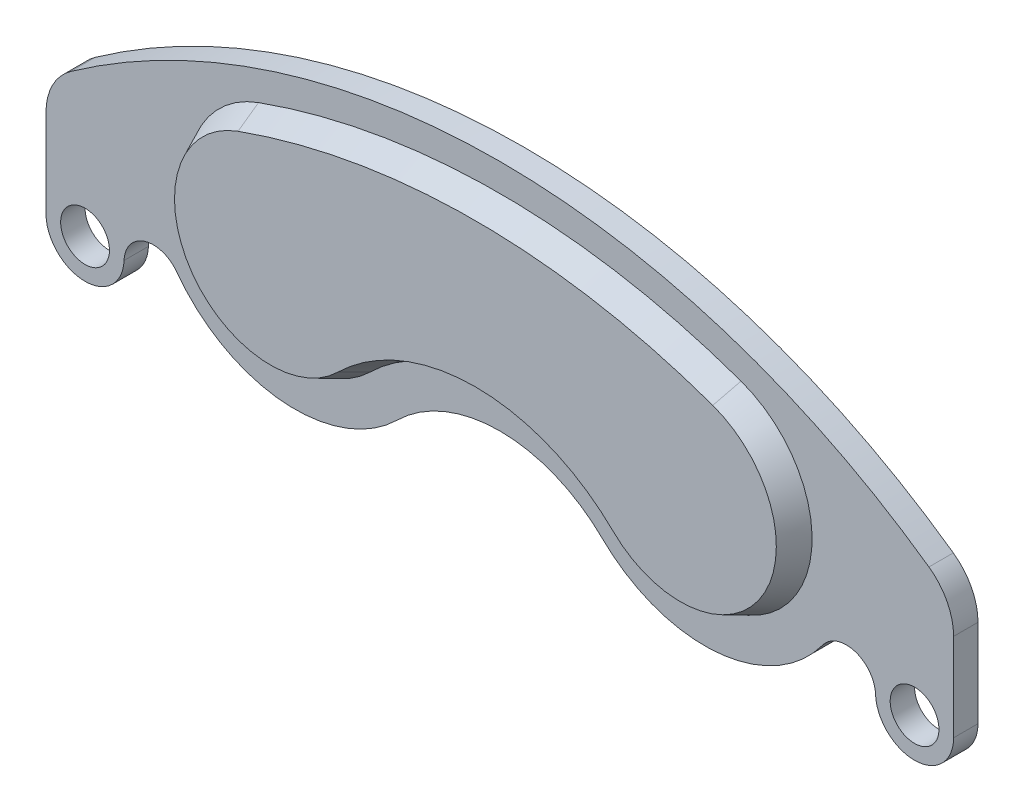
ISO-10303-21;
HEADER;
FILE_DESCRIPTION(('STEP AP214'),'2;1');
FILE_NAME('part.step','',(''),(''),'','','');
FILE_SCHEMA(('AUTOMOTIVE_DESIGN { 1 0 10303 214 1 1 1 1 }'));
ENDSEC;
DATA;
#1=APPLICATION_CONTEXT('core data for automotive mechanical design processes');
#2=APPLICATION_PROTOCOL_DEFINITION('international standard','automotive_design',2000,#1);
#3=PRODUCT_CONTEXT('',#1,'mechanical');
#4=PRODUCT('Part','Part','',(#3));
#5=PRODUCT_RELATED_PRODUCT_CATEGORY('part','',(#4));
#6=PRODUCT_DEFINITION_FORMATION('','',#4);
#7=PRODUCT_DEFINITION_CONTEXT('part definition',#1,'design');
#8=PRODUCT_DEFINITION('design','',#6,#7);
#9=PRODUCT_DEFINITION_SHAPE('','',#8);
#10=(LENGTH_UNIT() NAMED_UNIT(*) SI_UNIT(.MILLI.,.METRE.));
#11=(NAMED_UNIT(*) PLANE_ANGLE_UNIT() SI_UNIT($,.RADIAN.));
#12=(NAMED_UNIT(*) SI_UNIT($,.STERADIAN.) SOLID_ANGLE_UNIT());
#13=UNCERTAINTY_MEASURE_WITH_UNIT(LENGTH_MEASURE(1.E-05),#10,'distance_accuracy_value','');
#14=(GEOMETRIC_REPRESENTATION_CONTEXT(3) GLOBAL_UNCERTAINTY_ASSIGNED_CONTEXT((#13)) GLOBAL_UNIT_ASSIGNED_CONTEXT((#10,
#11,#12)) REPRESENTATION_CONTEXT('',''));
#15=CARTESIAN_POINT('',(0.,0.,0.));
#16=DIRECTION('',(0.,0.,1.));
#17=DIRECTION('',(1.,0.,0.));
#18=AXIS2_PLACEMENT_3D('',#15,#16,#17);
#19=CARTESIAN_POINT('',(21.,21.4242852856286,1.25));
#20=DIRECTION('',(0.,0.,1.));
#21=DIRECTION('',(1.,0.,0.));
#22=AXIS2_PLACEMENT_3D('',#19,#20,#21);
#23=PLANE('',#22);
#24=CARTESIAN_POINT('',(0.,0.,1.25));
#25=DIRECTION('',(0.,0.,-1.));
#26=DIRECTION('',(-1.,0.,0.));
#27=AXIS2_PLACEMENT_3D('',#24,#25,#26);
#28=CIRCLE('',#27,19.);
#29=CARTESIAN_POINT('',(-13.3,13.5687140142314,1.25));
#30=VERTEX_POINT('',#29);
#31=CARTESIAN_POINT('',(13.3,13.5687140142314,1.25));
#32=VERTEX_POINT('',#31);
#33=EDGE_CURVE('E354',#30,#32,#28,.T.);
#34=ORIENTED_EDGE('',*,*,#33,.F.);
#35=CARTESIAN_POINT('',(-21.,21.4242852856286,1.25));
#36=DIRECTION('',(0.,0.,1.));
#37=DIRECTION('',(1.,0.,0.));
#38=AXIS2_PLACEMENT_3D('',#35,#36,#37);
#39=CIRCLE('',#38,11.);
#40=CARTESIAN_POINT('',(-24.7165122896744,31.7774266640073,1.25));
#41=VERTEX_POINT('',#40);
#42=EDGE_CURVE('E358',#41,#30,#39,.T.);
#43=ORIENTED_EDGE('',*,*,#42,.F.);
#44=CARTESIAN_POINT('',(0.,-37.0757147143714,1.25));
#45=DIRECTION('',(0.,0.,1.));
#46=DIRECTION('',(1.,0.,0.));
#47=AXIS2_PLACEMENT_3D('',#44,#45,#46);
#48=CIRCLE('',#47,73.155048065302);
#49=CARTESIAN_POINT('',(24.7165122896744,31.7774266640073,1.25));
#50=VERTEX_POINT('',#49);
#51=EDGE_CURVE('E336',#50,#41,#48,.T.);
#52=ORIENTED_EDGE('',*,*,#51,.F.);
#53=CARTESIAN_POINT('',(21.,21.4242852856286,1.25));
#54=DIRECTION('',(0.,0.,1.));
#55=DIRECTION('',(1.,0.,0.));
#56=AXIS2_PLACEMENT_3D('',#53,#54,#55);
#57=CIRCLE('',#56,11.);
#58=EDGE_CURVE('E351',#32,#50,#57,.T.);
#59=ORIENTED_EDGE('',*,*,#58,.F.);
#60=EDGE_LOOP('',(#34,#43,#52,#59));
#61=FACE_BOUND('',#60,.T.);
#62=CARTESIAN_POINT('',(-42.5,11.0185056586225,1.25));
#63=DIRECTION('',(0.,0.,1.));
#64=DIRECTION('',(1.,0.,0.));
#65=AXIS2_PLACEMENT_3D('',#62,#63,#64);
#66=CIRCLE('',#65,2.5);
#67=CARTESIAN_POINT('',(-40.,11.0185056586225,1.25));
#68=VERTEX_POINT('',#67);
#69=EDGE_CURVE('E181',#68,#68,#66,.T.);
#70=ORIENTED_EDGE('',*,*,#69,.F.);
#71=EDGE_LOOP('',(#70));
#72=FACE_BOUND('',#71,.T.);
#73=CARTESIAN_POINT('',(21.,21.4242852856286,1.25));
#74=DIRECTION('',(0.,0.,1.));
#75=DIRECTION('',(1.,0.,0.));
#76=AXIS2_PLACEMENT_3D('',#73,#74,#75);
#77=CIRCLE('',#76,15.);
#78=CARTESIAN_POINT('',(10.5,10.7121426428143,1.25));
#79=VERTEX_POINT('',#78);
#80=CARTESIAN_POINT('',(33.0871551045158,12.5416797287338,1.25));
#81=VERTEX_POINT('',#80);
#82=EDGE_CURVE('E213',#79,#81,#77,.T.);
#83=ORIENTED_EDGE('',*,*,#82,.T.);
#84=CARTESIAN_POINT('',(35.504586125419,10.7651586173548,1.25));
#85=DIRECTION('',(0.,0.,-1.));
#86=DIRECTION('',(-1.,0.,0.));
#87=AXIS2_PLACEMENT_3D('',#84,#85,#86);
#88=CIRCLE('',#87,3.);
#89=CARTESIAN_POINT('',(38.5026206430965,10.8737359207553,1.25));
#90=VERTEX_POINT('',#89);
#91=EDGE_CURVE('E117',#81,#90,#88,.T.);
#92=ORIENTED_EDGE('',*,*,#91,.T.);
#93=CARTESIAN_POINT('',(42.5,11.0185056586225,1.25));
#94=DIRECTION('',(0.,0.,1.));
#95=DIRECTION('',(1.,0.,0.));
#96=AXIS2_PLACEMENT_3D('',#93,#94,#95);
#97=CIRCLE('',#96,4.);
#98=CARTESIAN_POINT('',(46.5,11.0185056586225,1.25));
#99=VERTEX_POINT('',#98);
#100=EDGE_CURVE('E250',#90,#99,#97,.T.);
#101=ORIENTED_EDGE('',*,*,#100,.T.);
#102=DIRECTION('',(0.,1.,0.));
#103=VECTOR('',#102,1.);
#104=CARTESIAN_POINT('',(46.5,11.0185056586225,1.25));
#105=LINE('',#104,#103);
#106=CARTESIAN_POINT('',(46.5,20.0185056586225,1.25));
#107=VERTEX_POINT('',#106);
#108=EDGE_CURVE('E269',#99,#107,#105,.T.);
#109=ORIENTED_EDGE('',*,*,#108,.T.);
#110=CARTESIAN_POINT('',(40.5,20.0185056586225,1.25));
#111=DIRECTION('',(0.,0.,1.));
#112=DIRECTION('',(1.,0.,0.));
#113=AXIS2_PLACEMENT_3D('',#110,#111,#112);
#114=CIRCLE('',#113,6.);
#115=CARTESIAN_POINT('',(43.9714285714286,24.9122959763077,1.25));
#116=VERTEX_POINT('',#115);
#117=EDGE_CURVE('E265',#107,#116,#114,.T.);
#118=ORIENTED_EDGE('',*,*,#117,.T.);
#119=CARTESIAN_POINT('',(0.,-37.0757147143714,1.25));
#120=DIRECTION('',(0.,0.,1.));
#121=DIRECTION('',(1.,0.,0.));
#122=AXIS2_PLACEMENT_3D('',#119,#120,#121);
#123=CIRCLE('',#122,76.);
#124=CARTESIAN_POINT('',(-43.9714285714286,24.9122959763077,1.25));
#125=VERTEX_POINT('',#124);
#126=EDGE_CURVE('E268',#116,#125,#123,.T.);
#127=ORIENTED_EDGE('',*,*,#126,.T.);
#128=CARTESIAN_POINT('',(-40.5,20.0185056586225,1.25));
#129=DIRECTION('',(0.,0.,1.));
#130=DIRECTION('',(-1.,0.,0.));
#131=AXIS2_PLACEMENT_3D('',#128,#129,#130);
#132=CIRCLE('',#131,6.);
#133=CARTESIAN_POINT('',(-46.5,20.0185056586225,1.25));
#134=VERTEX_POINT('',#133);
#135=EDGE_CURVE('E273',#125,#134,#132,.T.);
#136=ORIENTED_EDGE('',*,*,#135,.T.);
#137=DIRECTION('',(0.,-1.,0.));
#138=VECTOR('',#137,1.);
#139=CARTESIAN_POINT('',(-46.5,11.0185056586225,1.25));
#140=LINE('',#139,#138);
#141=CARTESIAN_POINT('',(-46.5,11.0185056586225,1.25));
#142=VERTEX_POINT('',#141);
#143=EDGE_CURVE('E280',#134,#142,#140,.T.);
#144=ORIENTED_EDGE('',*,*,#143,.T.);
#145=CARTESIAN_POINT('',(-42.5,11.0185056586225,1.25));
#146=DIRECTION('',(0.,0.,1.));
#147=DIRECTION('',(-1.,0.,0.));
#148=AXIS2_PLACEMENT_3D('',#145,#146,#147);
#149=CIRCLE('',#148,4.00000000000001);
#150=CARTESIAN_POINT('',(-38.5026206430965,10.8737359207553,1.25));
#151=VERTEX_POINT('',#150);
#152=EDGE_CURVE('E151',#142,#151,#149,.T.);
#153=ORIENTED_EDGE('',*,*,#152,.T.);
#154=CARTESIAN_POINT('',(-35.504586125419,10.7651586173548,1.25));
#155=DIRECTION('',(0.,0.,-1.));
#156=DIRECTION('',(1.,0.,0.));
#157=AXIS2_PLACEMENT_3D('',#154,#155,#156);
#158=CIRCLE('',#157,3.);
#159=CARTESIAN_POINT('',(-33.0871551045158,12.5416797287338,1.25));
#160=VERTEX_POINT('',#159);
#161=EDGE_CURVE('E144',#151,#160,#158,.T.);
#162=ORIENTED_EDGE('',*,*,#161,.T.);
#163=CARTESIAN_POINT('',(-21.,21.4242852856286,1.25));
#164=DIRECTION('',(0.,0.,1.));
#165=DIRECTION('',(-1.,0.,0.));
#166=AXIS2_PLACEMENT_3D('',#163,#164,#165);
#167=CIRCLE('',#166,15.);
#168=CARTESIAN_POINT('',(-10.5,10.7121426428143,1.25));
#169=VERTEX_POINT('',#168);
#170=EDGE_CURVE('E148',#160,#169,#167,.T.);
#171=ORIENTED_EDGE('',*,*,#170,.T.);
#172=CARTESIAN_POINT('',(0.,0.,1.25));
#173=DIRECTION('',(0.,0.,-1.));
#174=DIRECTION('',(-1.,0.,0.));
#175=AXIS2_PLACEMENT_3D('',#172,#173,#174);
#176=CIRCLE('',#175,15.);
#177=EDGE_CURVE('E64',#169,#79,#176,.T.);
#178=ORIENTED_EDGE('',*,*,#177,.T.);
#179=EDGE_LOOP('',(#83,#92,#101,#109,#118,#127,#136,#144,#153,#162,#171,#178));
#180=FACE_BOUND('',#179,.T.);
#181=CARTESIAN_POINT('',(42.5,11.0185056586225,1.25));
#182=DIRECTION('',(0.,0.,1.));
#183=DIRECTION('',(-1.,0.,0.));
#184=AXIS2_PLACEMENT_3D('',#181,#182,#183);
#185=CIRCLE('',#184,2.5);
#186=CARTESIAN_POINT('',(40.,11.0185056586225,1.25));
#187=VERTEX_POINT('',#186);
#188=EDGE_CURVE('E307',#187,#187,#185,.T.);
#189=ORIENTED_EDGE('',*,*,#188,.F.);
#190=EDGE_LOOP('',(#189));
#191=FACE_BOUND('',#190,.T.);
#192=ADVANCED_FACE('F39',(#61,#72,#180,#191),#23,.T.);
#193=CARTESIAN_POINT('',(21.,21.4242852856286,-1.25));
#194=DIRECTION('',(0.,0.,1.));
#195=DIRECTION('',(1.,0.,0.));
#196=AXIS2_PLACEMENT_3D('',#193,#194,#195);
#197=PLANE('',#196);
#198=CARTESIAN_POINT('',(21.,21.4242852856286,-1.25));
#199=DIRECTION('',(0.,0.,1.));
#200=DIRECTION('',(1.,0.,0.));
#201=AXIS2_PLACEMENT_3D('',#198,#199,#200);
#202=CIRCLE('',#201,15.);
#203=CARTESIAN_POINT('',(10.5,10.7121426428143,-1.25));
#204=VERTEX_POINT('',#203);
#205=CARTESIAN_POINT('',(33.0871551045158,12.5416797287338,-1.25));
#206=VERTEX_POINT('',#205);
#207=EDGE_CURVE('E176',#204,#206,#202,.T.);
#208=ORIENTED_EDGE('',*,*,#207,.F.);
#209=CARTESIAN_POINT('',(0.,0.,-1.25));
#210=DIRECTION('',(0.,0.,-1.));
#211=DIRECTION('',(-1.,0.,0.));
#212=AXIS2_PLACEMENT_3D('',#209,#210,#211);
#213=CIRCLE('',#212,15.);
#214=CARTESIAN_POINT('',(-10.5,10.7121426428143,-1.25));
#215=VERTEX_POINT('',#214);
#216=EDGE_CURVE('E109',#215,#204,#213,.T.);
#217=ORIENTED_EDGE('',*,*,#216,.F.);
#218=CARTESIAN_POINT('',(-21.,21.4242852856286,-1.25));
#219=DIRECTION('',(0.,0.,1.));
#220=DIRECTION('',(-1.,0.,0.));
#221=AXIS2_PLACEMENT_3D('',#218,#219,#220);
#222=CIRCLE('',#221,15.);
#223=CARTESIAN_POINT('',(-33.0871551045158,12.5416797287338,-1.25));
#224=VERTEX_POINT('',#223);
#225=EDGE_CURVE('E208',#224,#215,#222,.T.);
#226=ORIENTED_EDGE('',*,*,#225,.F.);
#227=CARTESIAN_POINT('',(-35.504586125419,10.7651586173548,-1.25));
#228=DIRECTION('',(0.,0.,-1.));
#229=DIRECTION('',(1.,0.,0.));
#230=AXIS2_PLACEMENT_3D('',#227,#228,#229);
#231=CIRCLE('',#230,3.);
#232=CARTESIAN_POINT('',(-38.5026206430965,10.8737359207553,-1.25));
#233=VERTEX_POINT('',#232);
#234=EDGE_CURVE('E161',#233,#224,#231,.T.);
#235=ORIENTED_EDGE('',*,*,#234,.F.);
#236=CARTESIAN_POINT('',(-42.5,11.0185056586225,-1.25));
#237=DIRECTION('',(0.,0.,1.));
#238=DIRECTION('',(-1.,0.,0.));
#239=AXIS2_PLACEMENT_3D('',#236,#237,#238);
#240=CIRCLE('',#239,4.00000000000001);
#241=CARTESIAN_POINT('',(-46.5,11.0185056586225,-1.25));
#242=VERTEX_POINT('',#241);
#243=EDGE_CURVE('E203',#242,#233,#240,.T.);
#244=ORIENTED_EDGE('',*,*,#243,.F.);
#245=DIRECTION('',(0.,-1.,0.));
#246=VECTOR('',#245,1.);
#247=CARTESIAN_POINT('',(-46.5,11.0185056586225,-1.25));
#248=LINE('',#247,#246);
#249=CARTESIAN_POINT('',(-46.5,20.0185056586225,-1.25));
#250=VERTEX_POINT('',#249);
#251=EDGE_CURVE('E200',#250,#242,#248,.T.);
#252=ORIENTED_EDGE('',*,*,#251,.F.);
#253=CARTESIAN_POINT('',(-40.5,20.0185056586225,-1.25));
#254=DIRECTION('',(0.,0.,1.));
#255=DIRECTION('',(-1.,0.,0.));
#256=AXIS2_PLACEMENT_3D('',#253,#254,#255);
#257=CIRCLE('',#256,6.);
#258=CARTESIAN_POINT('',(-43.9714285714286,24.9122959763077,-1.25));
#259=VERTEX_POINT('',#258);
#260=EDGE_CURVE('E197',#259,#250,#257,.T.);
#261=ORIENTED_EDGE('',*,*,#260,.F.);
#262=CARTESIAN_POINT('',(0.,-37.0757147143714,-1.25));
#263=DIRECTION('',(0.,0.,1.));
#264=DIRECTION('',(-1.,0.,0.));
#265=AXIS2_PLACEMENT_3D('',#262,#263,#264);
#266=CIRCLE('',#265,76.);
#267=CARTESIAN_POINT('',(43.9714285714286,24.9122959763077,-1.25));
#268=VERTEX_POINT('',#267);
#269=EDGE_CURVE('E194',#268,#259,#266,.T.);
#270=ORIENTED_EDGE('',*,*,#269,.F.);
#271=CARTESIAN_POINT('',(40.5,20.0185056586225,-1.25));
#272=DIRECTION('',(0.,0.,1.));
#273=DIRECTION('',(1.,0.,0.));
#274=AXIS2_PLACEMENT_3D('',#271,#272,#273);
#275=CIRCLE('',#274,6.);
#276=CARTESIAN_POINT('',(46.5,20.0185056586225,-1.25));
#277=VERTEX_POINT('',#276);
#278=EDGE_CURVE('E190',#277,#268,#275,.T.);
#279=ORIENTED_EDGE('',*,*,#278,.F.);
#280=DIRECTION('',(0.,1.,0.));
#281=VECTOR('',#280,1.);
#282=CARTESIAN_POINT('',(46.5,11.0185056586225,-1.25));
#283=LINE('',#282,#281);
#284=CARTESIAN_POINT('',(46.5,11.0185056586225,-1.25));
#285=VERTEX_POINT('',#284);
#286=EDGE_CURVE('E187',#285,#277,#283,.T.);
#287=ORIENTED_EDGE('',*,*,#286,.F.);
#288=CARTESIAN_POINT('',(42.5,11.0185056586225,-1.25));
#289=DIRECTION('',(0.,0.,1.));
#290=DIRECTION('',(1.,0.,0.));
#291=AXIS2_PLACEMENT_3D('',#288,#289,#290);
#292=CIRCLE('',#291,4.);
#293=CARTESIAN_POINT('',(38.5026206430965,10.8737359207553,-1.25));
#294=VERTEX_POINT('',#293);
#295=EDGE_CURVE('E184',#294,#285,#292,.T.);
#296=ORIENTED_EDGE('',*,*,#295,.F.);
#297=CARTESIAN_POINT('',(35.504586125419,10.7651586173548,-1.25));
#298=DIRECTION('',(0.,0.,-1.));
#299=DIRECTION('',(-1.,0.,0.));
#300=AXIS2_PLACEMENT_3D('',#297,#298,#299);
#301=CIRCLE('',#300,3.);
#302=EDGE_CURVE('E180',#206,#294,#301,.T.);
#303=ORIENTED_EDGE('',*,*,#302,.F.);
#304=EDGE_LOOP('',(#208,#217,#226,#235,#244,#252,#261,#270,#279,#287,#296,#303));
#305=FACE_BOUND('',#304,.T.);
#306=CARTESIAN_POINT('',(-42.5,11.0185056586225,-1.25));
#307=DIRECTION('',(0.,0.,1.));
#308=DIRECTION('',(1.,0.,0.));
#309=AXIS2_PLACEMENT_3D('',#306,#307,#308);
#310=CIRCLE('',#309,2.5);
#311=CARTESIAN_POINT('',(-40.,11.0185056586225,-1.25));
#312=VERTEX_POINT('',#311);
#313=EDGE_CURVE('E302',#312,#312,#310,.T.);
#314=ORIENTED_EDGE('',*,*,#313,.T.);
#315=EDGE_LOOP('',(#314));
#316=FACE_BOUND('',#315,.T.);
#317=CARTESIAN_POINT('',(42.5,11.0185056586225,-1.25));
#318=DIRECTION('',(0.,0.,1.));
#319=DIRECTION('',(-1.,0.,0.));
#320=AXIS2_PLACEMENT_3D('',#317,#318,#319);
#321=CIRCLE('',#320,2.5);
#322=CARTESIAN_POINT('',(40.,11.0185056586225,-1.25));
#323=VERTEX_POINT('',#322);
#324=EDGE_CURVE('E311',#323,#323,#321,.T.);
#325=ORIENTED_EDGE('',*,*,#324,.T.);
#326=EDGE_LOOP('',(#325));
#327=FACE_BOUND('',#326,.T.);
#328=ADVANCED_FACE('F254',(#305,#316,#327),#197,.F.);
#329=CARTESIAN_POINT('',(21.,21.4242852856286,1.25));
#330=DIRECTION('',(0.,0.,-1.));
#331=DIRECTION('',(-1.,0.,0.));
#332=AXIS2_PLACEMENT_3D('',#329,#330,#331);
#333=CYLINDRICAL_SURFACE('',#332,15.);
#334=ORIENTED_EDGE('',*,*,#207,.T.);
#335=DIRECTION('',(0.,0.,-1.));
#336=VECTOR('',#335,1.);
#337=CARTESIAN_POINT('',(33.0871551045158,12.5416797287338,1.25));
#338=LINE('',#337,#336);
#339=EDGE_CURVE('E11',#81,#206,#338,.T.);
#340=ORIENTED_EDGE('',*,*,#339,.F.);
#341=ORIENTED_EDGE('',*,*,#82,.F.);
#342=DIRECTION('',(0.,0.,-1.));
#343=VECTOR('',#342,1.);
#344=CARTESIAN_POINT('',(10.5,10.7121426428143,1.25));
#345=LINE('',#344,#343);
#346=EDGE_CURVE('E172',#79,#204,#345,.T.);
#347=ORIENTED_EDGE('',*,*,#346,.T.);
#348=EDGE_LOOP('',(#334,#340,#341,#347));
#349=FACE_BOUND('',#348,.T.);
#350=ADVANCED_FACE('F41',(#349),#333,.T.);
#351=CARTESIAN_POINT('',(35.504586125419,10.7651586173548,1.25));
#352=DIRECTION('',(0.,0.,-1.));
#353=DIRECTION('',(-1.,0.,0.));
#354=AXIS2_PLACEMENT_3D('',#351,#352,#353);
#355=CYLINDRICAL_SURFACE('',#354,3.);
#356=ORIENTED_EDGE('',*,*,#302,.T.);
#357=DIRECTION('',(0.,0.,-1.));
#358=VECTOR('',#357,1.);
#359=CARTESIAN_POINT('',(38.5026206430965,10.8737359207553,1.25));
#360=LINE('',#359,#358);
#361=EDGE_CURVE('E48',#90,#294,#360,.T.);
#362=ORIENTED_EDGE('',*,*,#361,.F.);
#363=ORIENTED_EDGE('',*,*,#91,.F.);
#364=ORIENTED_EDGE('',*,*,#339,.T.);
#365=EDGE_LOOP('',(#356,#362,#363,#364));
#366=FACE_BOUND('',#365,.T.);
#367=ADVANCED_FACE('F435',(#366),#355,.F.);
#368=CARTESIAN_POINT('',(42.5,11.0185056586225,1.25));
#369=DIRECTION('',(0.,0.,-1.));
#370=DIRECTION('',(-1.,0.,0.));
#371=AXIS2_PLACEMENT_3D('',#368,#369,#370);
#372=CYLINDRICAL_SURFACE('',#371,4.);
#373=ORIENTED_EDGE('',*,*,#295,.T.);
#374=DIRECTION('',(0.,0.,-1.));
#375=VECTOR('',#374,1.);
#376=CARTESIAN_POINT('',(46.5,11.0185056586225,1.25));
#377=LINE('',#376,#375);
#378=EDGE_CURVE('E240',#99,#285,#377,.T.);
#379=ORIENTED_EDGE('',*,*,#378,.F.);
#380=ORIENTED_EDGE('',*,*,#100,.F.);
#381=ORIENTED_EDGE('',*,*,#361,.T.);
#382=EDGE_LOOP('',(#373,#379,#380,#381));
#383=FACE_BOUND('',#382,.T.);
#384=ADVANCED_FACE('F248',(#383),#372,.T.);
#385=CARTESIAN_POINT('',(46.5,11.0185056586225,1.25));
#386=DIRECTION('',(-1.,0.,0.));
#387=DIRECTION('',(0.,-1.,0.));
#388=AXIS2_PLACEMENT_3D('',#385,#386,#387);
#389=PLANE('',#388);
#390=ORIENTED_EDGE('',*,*,#286,.T.);
#391=DIRECTION('',(0.,0.,-1.));
#392=VECTOR('',#391,1.);
#393=CARTESIAN_POINT('',(46.5,20.0185056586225,1.25));
#394=LINE('',#393,#392);
#395=EDGE_CURVE('E236',#107,#277,#394,.T.);
#396=ORIENTED_EDGE('',*,*,#395,.F.);
#397=ORIENTED_EDGE('',*,*,#108,.F.);
#398=ORIENTED_EDGE('',*,*,#378,.T.);
#399=EDGE_LOOP('',(#390,#396,#397,#398));
#400=FACE_BOUND('',#399,.T.);
#401=ADVANCED_FACE('F259',(#400),#389,.F.);
#402=CARTESIAN_POINT('',(40.5,20.0185056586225,1.25));
#403=DIRECTION('',(0.,0.,-1.));
#404=DIRECTION('',(-1.,0.,0.));
#405=AXIS2_PLACEMENT_3D('',#402,#403,#404);
#406=CYLINDRICAL_SURFACE('',#405,6.);
#407=ORIENTED_EDGE('',*,*,#278,.T.);
#408=DIRECTION('',(0.,0.,-1.));
#409=VECTOR('',#408,1.);
#410=CARTESIAN_POINT('',(43.9714285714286,24.9122959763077,1.25));
#411=LINE('',#410,#409);
#412=EDGE_CURVE('E232',#116,#268,#411,.T.);
#413=ORIENTED_EDGE('',*,*,#412,.F.);
#414=ORIENTED_EDGE('',*,*,#117,.F.);
#415=ORIENTED_EDGE('',*,*,#395,.T.);
#416=EDGE_LOOP('',(#407,#413,#414,#415));
#417=FACE_BOUND('',#416,.T.);
#418=ADVANCED_FACE('F263',(#417),#406,.T.);
#419=CARTESIAN_POINT('',(0.,-37.0757147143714,1.25));
#420=DIRECTION('',(0.,0.,-1.));
#421=DIRECTION('',(-1.,0.,0.));
#422=AXIS2_PLACEMENT_3D('',#419,#420,#421);
#423=CYLINDRICAL_SURFACE('',#422,76.);
#424=ORIENTED_EDGE('',*,*,#269,.T.);
#425=DIRECTION('',(0.,0.,-1.));
#426=VECTOR('',#425,1.);
#427=CARTESIAN_POINT('',(-43.9714285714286,24.9122959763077,1.25));
#428=LINE('',#427,#426);
#429=EDGE_CURVE('E228',#125,#259,#428,.T.);
#430=ORIENTED_EDGE('',*,*,#429,.F.);
#431=ORIENTED_EDGE('',*,*,#126,.F.);
#432=ORIENTED_EDGE('',*,*,#412,.T.);
#433=EDGE_LOOP('',(#424,#430,#431,#432));
#434=FACE_BOUND('',#433,.T.);
#435=ADVANCED_FACE('F425',(#434),#423,.T.);
#436=CARTESIAN_POINT('',(-40.5,20.0185056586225,1.25));
#437=DIRECTION('',(0.,0.,-1.));
#438=DIRECTION('',(-1.,0.,0.));
#439=AXIS2_PLACEMENT_3D('',#436,#437,#438);
#440=CYLINDRICAL_SURFACE('',#439,6.);
#441=ORIENTED_EDGE('',*,*,#260,.T.);
#442=DIRECTION('',(0.,0.,-1.));
#443=VECTOR('',#442,1.);
#444=CARTESIAN_POINT('',(-46.5,20.0185056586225,1.25));
#445=LINE('',#444,#443);
#446=EDGE_CURVE('E224',#134,#250,#445,.T.);
#447=ORIENTED_EDGE('',*,*,#446,.F.);
#448=ORIENTED_EDGE('',*,*,#135,.F.);
#449=ORIENTED_EDGE('',*,*,#429,.T.);
#450=EDGE_LOOP('',(#441,#447,#448,#449));
#451=FACE_BOUND('',#450,.T.);
#452=ADVANCED_FACE('F422',(#451),#440,.T.);
#453=CARTESIAN_POINT('',(-46.5,11.0185056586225,1.25));
#454=DIRECTION('',(1.,0.,0.));
#455=DIRECTION('',(0.,1.,0.));
#456=AXIS2_PLACEMENT_3D('',#453,#454,#455);
#457=PLANE('',#456);
#458=ORIENTED_EDGE('',*,*,#251,.T.);
#459=DIRECTION('',(0.,0.,-1.));
#460=VECTOR('',#459,1.);
#461=CARTESIAN_POINT('',(-46.5,11.0185056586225,1.25));
#462=LINE('',#461,#460);
#463=EDGE_CURVE('E220',#142,#242,#462,.T.);
#464=ORIENTED_EDGE('',*,*,#463,.F.);
#465=ORIENTED_EDGE('',*,*,#143,.F.);
#466=ORIENTED_EDGE('',*,*,#446,.T.);
#467=EDGE_LOOP('',(#458,#464,#465,#466));
#468=FACE_BOUND('',#467,.T.);
#469=ADVANCED_FACE('F288',(#468),#457,.F.);
#470=CARTESIAN_POINT('',(-42.5,11.0185056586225,1.25));
#471=DIRECTION('',(0.,0.,-1.));
#472=DIRECTION('',(-1.,0.,0.));
#473=AXIS2_PLACEMENT_3D('',#470,#471,#472);
#474=CYLINDRICAL_SURFACE('',#473,4.00000000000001);
#475=ORIENTED_EDGE('',*,*,#243,.T.);
#476=DIRECTION('',(0.,0.,-1.));
#477=VECTOR('',#476,1.);
#478=CARTESIAN_POINT('',(-38.5026206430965,10.8737359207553,1.25));
#479=LINE('',#478,#477);
#480=EDGE_CURVE('E165',#151,#233,#479,.T.);
#481=ORIENTED_EDGE('',*,*,#480,.F.);
#482=ORIENTED_EDGE('',*,*,#152,.F.);
#483=ORIENTED_EDGE('',*,*,#463,.T.);
#484=EDGE_LOOP('',(#475,#481,#482,#483));
#485=FACE_BOUND('',#484,.T.);
#486=ADVANCED_FACE('F292',(#485),#474,.T.);
#487=CARTESIAN_POINT('',(-35.504586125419,10.7651586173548,1.25));
#488=DIRECTION('',(0.,0.,-1.));
#489=DIRECTION('',(-1.,0.,0.));
#490=AXIS2_PLACEMENT_3D('',#487,#488,#489);
#491=CYLINDRICAL_SURFACE('',#490,3.);
#492=ORIENTED_EDGE('',*,*,#234,.T.);
#493=DIRECTION('',(0.,0.,-1.));
#494=VECTOR('',#493,1.);
#495=CARTESIAN_POINT('',(-33.0871551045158,12.5416797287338,1.25));
#496=LINE('',#495,#494);
#497=EDGE_CURVE('E158',#160,#224,#496,.T.);
#498=ORIENTED_EDGE('',*,*,#497,.F.);
#499=ORIENTED_EDGE('',*,*,#161,.F.);
#500=ORIENTED_EDGE('',*,*,#480,.T.);
#501=EDGE_LOOP('',(#492,#498,#499,#500));
#502=FACE_BOUND('',#501,.T.);
#503=ADVANCED_FACE('F159',(#502),#491,.F.);
#504=CARTESIAN_POINT('',(-21.,21.4242852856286,1.25));
#505=DIRECTION('',(0.,0.,-1.));
#506=DIRECTION('',(-1.,0.,0.));
#507=AXIS2_PLACEMENT_3D('',#504,#505,#506);
#508=CYLINDRICAL_SURFACE('',#507,15.);
#509=ORIENTED_EDGE('',*,*,#225,.T.);
#510=DIRECTION('',(0.,0.,-1.));
#511=VECTOR('',#510,1.);
#512=CARTESIAN_POINT('',(-10.5,10.7121426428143,1.25));
#513=LINE('',#512,#511);
#514=EDGE_CURVE('E166',#169,#215,#513,.T.);
#515=ORIENTED_EDGE('',*,*,#514,.F.);
#516=ORIENTED_EDGE('',*,*,#170,.F.);
#517=ORIENTED_EDGE('',*,*,#497,.T.);
#518=EDGE_LOOP('',(#509,#515,#516,#517));
#519=FACE_BOUND('',#518,.T.);
#520=ADVANCED_FACE('F168',(#519),#508,.T.);
#521=CARTESIAN_POINT('',(0.,0.,1.25));
#522=DIRECTION('',(0.,0.,-1.));
#523=DIRECTION('',(-1.,0.,0.));
#524=AXIS2_PLACEMENT_3D('',#521,#522,#523);
#525=CYLINDRICAL_SURFACE('',#524,15.);
#526=ORIENTED_EDGE('',*,*,#216,.T.);
#527=ORIENTED_EDGE('',*,*,#346,.F.);
#528=ORIENTED_EDGE('',*,*,#177,.F.);
#529=ORIENTED_EDGE('',*,*,#514,.T.);
#530=EDGE_LOOP('',(#526,#527,#528,#529));
#531=FACE_BOUND('',#530,.T.);
#532=ADVANCED_FACE('F293',(#531),#525,.F.);
#533=CARTESIAN_POINT('',(-42.5,11.0185056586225,1.25));
#534=DIRECTION('',(0.,0.,-1.));
#535=DIRECTION('',(-1.,0.,0.));
#536=AXIS2_PLACEMENT_3D('',#533,#534,#535);
#537=CYLINDRICAL_SURFACE('',#536,2.5);
#538=ORIENTED_EDGE('',*,*,#69,.T.);
#539=EDGE_LOOP('',(#538));
#540=FACE_BOUND('',#539,.T.);
#541=ORIENTED_EDGE('',*,*,#313,.F.);
#542=EDGE_LOOP('',(#541));
#543=FACE_BOUND('',#542,.T.);
#544=ADVANCED_FACE('F409',(#540,#543),#537,.F.);
#545=CARTESIAN_POINT('',(42.5,11.0185056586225,1.25));
#546=DIRECTION('',(0.,0.,-1.));
#547=DIRECTION('',(-1.,0.,0.));
#548=AXIS2_PLACEMENT_3D('',#545,#546,#547);
#549=CYLINDRICAL_SURFACE('',#548,2.5);
#550=ORIENTED_EDGE('',*,*,#188,.T.);
#551=EDGE_LOOP('',(#550));
#552=FACE_BOUND('',#551,.T.);
#553=ORIENTED_EDGE('',*,*,#324,.F.);
#554=EDGE_LOOP('',(#553));
#555=FACE_BOUND('',#554,.T.);
#556=ADVANCED_FACE('F518',(#552,#555),#549,.F.);
#557=CARTESIAN_POINT('',(-21.,21.4242852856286,1.25));
#558=DIRECTION('',(0.,0.,-1.));
#559=DIRECTION('',(1.,0.,0.));
#560=AXIS2_PLACEMENT_3D('',#557,#558,#559);
#561=CONICAL_SURFACE('',#560,11.,0.436332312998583);
#562=ORIENTED_EDGE('',*,*,#42,.T.);
#563=DIRECTION('',(0.29583278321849,-0.30180980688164,-0.90630778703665));
#564=VECTOR('',#563,1.);
#565=CARTESIAN_POINT('',(-13.3,13.5687140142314,1.25));
#566=LINE('',#565,#564);
#567=CARTESIAN_POINT('',(-14.1160384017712,14.4012397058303,3.75));
#568=VERTEX_POINT('',#567);
#569=EDGE_CURVE('E315',#568,#30,#566,.T.);
#570=ORIENTED_EDGE('',*,*,#569,.F.);
#571=CARTESIAN_POINT('',(-21.,21.4242852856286,3.75));
#572=DIRECTION('',(0.,0.,1.));
#573=DIRECTION('',(1.,0.,0.));
#574=AXIS2_PLACEMENT_3D('',#571,#572,#573);
#575=CIRCLE('',#574,9.8342308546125);
#576=CARTESIAN_POINT('',(-24.3226399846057,30.6802109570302,3.75));
#577=VERTEX_POINT('',#576);
#578=EDGE_CURVE('E332',#577,#568,#575,.T.);
#579=ORIENTED_EDGE('',*,*,#578,.F.);
#580=DIRECTION('',(-0.142787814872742,0.397766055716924,-0.90630778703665));
#581=VECTOR('',#580,1.);
#582=CARTESIAN_POINT('',(-24.7165122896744,31.7774266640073,1.25));
#583=LINE('',#582,#581);
#584=EDGE_CURVE('E323',#577,#41,#583,.T.);
#585=ORIENTED_EDGE('',*,*,#584,.T.);
#586=EDGE_LOOP('',(#562,#570,#579,#585));
#587=FACE_BOUND('',#586,.T.);
#588=ADVANCED_FACE('F366',(#587),#561,.T.);
#589=CARTESIAN_POINT('',(0.,0.,1.25));
#590=DIRECTION('',(0.,0.,1.));
#591=DIRECTION('',(-1.,0.,0.));
#592=AXIS2_PLACEMENT_3D('',#589,#590,#591);
#593=CONICAL_SURFACE('',#592,19.,0.436332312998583);
#594=ORIENTED_EDGE('',*,*,#33,.T.);
#595=DIRECTION('',(-0.29583278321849,-0.30180980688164,-0.90630778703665));
#596=VECTOR('',#595,1.);
#597=CARTESIAN_POINT('',(13.3,13.5687140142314,1.25));
#598=LINE('',#597,#596);
#599=CARTESIAN_POINT('',(14.1160384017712,14.4012397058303,3.75));
#600=VERTEX_POINT('',#599);
#601=EDGE_CURVE('E337',#600,#32,#598,.T.);
#602=ORIENTED_EDGE('',*,*,#601,.F.);
#603=CARTESIAN_POINT('',(0.,0.,3.75));
#604=DIRECTION('',(0.,0.,1.));
#605=DIRECTION('',(1.,0.,0.));
#606=AXIS2_PLACEMENT_3D('',#603,#604,#605);
#607=CIRCLE('',#606,20.1657691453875);
#608=EDGE_CURVE('E328',#568,#600,#607,.F.);
#609=ORIENTED_EDGE('',*,*,#608,.F.);
#610=ORIENTED_EDGE('',*,*,#569,.T.);
#611=EDGE_LOOP('',(#594,#602,#609,#610));
#612=FACE_BOUND('',#611,.T.);
#613=ADVANCED_FACE('F379',(#612),#593,.F.);
#614=CARTESIAN_POINT('',(21.,21.4242852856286,1.25));
#615=DIRECTION('',(0.,0.,-1.));
#616=DIRECTION('',(1.,0.,0.));
#617=AXIS2_PLACEMENT_3D('',#614,#615,#616);
#618=CONICAL_SURFACE('',#617,11.,0.436332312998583);
#619=ORIENTED_EDGE('',*,*,#58,.T.);
#620=DIRECTION('',(0.142787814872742,0.397766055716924,-0.90630778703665));
#621=VECTOR('',#620,1.);
#622=CARTESIAN_POINT('',(24.7165122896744,31.7774266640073,1.25000000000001));
#623=LINE('',#622,#621);
#624=CARTESIAN_POINT('',(24.3226399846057,30.6802109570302,3.75));
#625=VERTEX_POINT('',#624);
#626=EDGE_CURVE('E55',#625,#50,#623,.T.);
#627=ORIENTED_EDGE('',*,*,#626,.F.);
#628=CARTESIAN_POINT('',(21.,21.4242852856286,3.75));
#629=DIRECTION('',(0.,0.,1.));
#630=DIRECTION('',(1.,0.,0.));
#631=AXIS2_PLACEMENT_3D('',#628,#629,#630);
#632=CIRCLE('',#631,9.8342308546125);
#633=EDGE_CURVE('E324',#600,#625,#632,.T.);
#634=ORIENTED_EDGE('',*,*,#633,.F.);
#635=ORIENTED_EDGE('',*,*,#601,.T.);
#636=EDGE_LOOP('',(#619,#627,#634,#635));
#637=FACE_BOUND('',#636,.T.);
#638=ADVANCED_FACE('F385',(#637),#618,.T.);
#639=CARTESIAN_POINT('',(0.,-37.0757147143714,1.25));
#640=DIRECTION('',(0.,0.,-1.));
#641=DIRECTION('',(1.,0.,0.));
#642=AXIS2_PLACEMENT_3D('',#639,#640,#641);
#643=CONICAL_SURFACE('',#642,73.155048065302,0.436332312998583);
#644=ORIENTED_EDGE('',*,*,#51,.T.);
#645=ORIENTED_EDGE('',*,*,#584,.F.);
#646=CARTESIAN_POINT('',(0.,-37.0757147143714,3.75));
#647=DIRECTION('',(0.,0.,1.));
#648=DIRECTION('',(1.,0.,0.));
#649=AXIS2_PLACEMENT_3D('',#646,#647,#648);
#650=CIRCLE('',#649,71.9892789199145);
#651=EDGE_CURVE('E319',#625,#577,#650,.T.);
#652=ORIENTED_EDGE('',*,*,#651,.F.);
#653=ORIENTED_EDGE('',*,*,#626,.T.);
#654=EDGE_LOOP('',(#644,#645,#652,#653));
#655=FACE_BOUND('',#654,.T.);
#656=ADVANCED_FACE('F392',(#655),#643,.T.);
#657=CARTESIAN_POINT('',(-10.5,10.7121426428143,3.75));
#658=DIRECTION('',(0.,0.,1.));
#659=DIRECTION('',(1.,0.,0.));
#660=AXIS2_PLACEMENT_3D('',#657,#658,#659);
#661=PLANE('',#660);
#662=ORIENTED_EDGE('',*,*,#578,.T.);
#663=ORIENTED_EDGE('',*,*,#608,.T.);
#664=ORIENTED_EDGE('',*,*,#633,.T.);
#665=ORIENTED_EDGE('',*,*,#651,.T.);
#666=EDGE_LOOP('',(#662,#663,#664,#665));
#667=FACE_BOUND('',#666,.T.);
#668=ADVANCED_FACE('F389',(#667),#661,.T.);
#669=CLOSED_SHELL('',(#192,#328,#350,#367,#384,#401,#418,#435,#452,#469,#486,#503,#520,#532,
#544,#556,#588,#613,#638,#656,#668));
#670=MANIFOLD_SOLID_BREP('B2',#669);
#671=ADVANCED_BREP_SHAPE_REPRESENTATION('',(#18,#670),#14);
#672=SHAPE_DEFINITION_REPRESENTATION(#9,#671);
ENDSEC;
END-ISO-10303-21;
